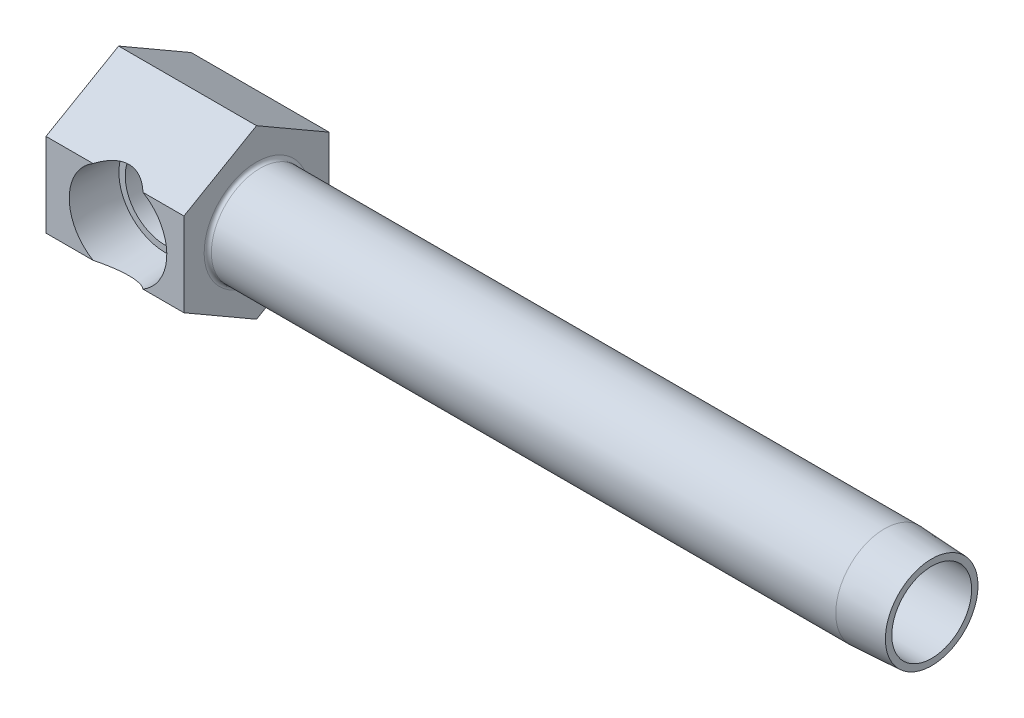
ISO-10303-21;
HEADER;
FILE_DESCRIPTION(('STEP AP214'),'2;1');
FILE_NAME('part.step','',(''),(''),'','','');
FILE_SCHEMA(('AUTOMOTIVE_DESIGN { 1 0 10303 214 1 1 1 1 }'));
ENDSEC;
DATA;
#1=APPLICATION_CONTEXT('core data for automotive mechanical design processes');
#2=APPLICATION_PROTOCOL_DEFINITION('international standard','automotive_design',2000,#1);
#3=PRODUCT_CONTEXT('',#1,'mechanical');
#4=PRODUCT('Part','Part','',(#3));
#5=PRODUCT_RELATED_PRODUCT_CATEGORY('part','',(#4));
#6=PRODUCT_DEFINITION_FORMATION('','',#4);
#7=PRODUCT_DEFINITION_CONTEXT('part definition',#1,'design');
#8=PRODUCT_DEFINITION('design','',#6,#7);
#9=PRODUCT_DEFINITION_SHAPE('','',#8);
#10=(LENGTH_UNIT() NAMED_UNIT(*) SI_UNIT(.MILLI.,.METRE.));
#11=(NAMED_UNIT(*) PLANE_ANGLE_UNIT() SI_UNIT($,.RADIAN.));
#12=(NAMED_UNIT(*) SI_UNIT($,.STERADIAN.) SOLID_ANGLE_UNIT());
#13=UNCERTAINTY_MEASURE_WITH_UNIT(LENGTH_MEASURE(1.E-05),#10,'distance_accuracy_value','');
#14=(GEOMETRIC_REPRESENTATION_CONTEXT(3) GLOBAL_UNCERTAINTY_ASSIGNED_CONTEXT((#13)) GLOBAL_UNIT_ASSIGNED_CONTEXT((#10,
#11,#12)) REPRESENTATION_CONTEXT('',''));
#15=CARTESIAN_POINT('',(0.,0.,0.));
#16=DIRECTION('',(0.,0.,1.));
#17=DIRECTION('',(1.,0.,0.));
#18=AXIS2_PLACEMENT_3D('',#15,#16,#17);
#19=CARTESIAN_POINT('',(63.5,0.,15.875));
#20=DIRECTION('',(-1.,0.,0.));
#21=DIRECTION('',(0.,0.,1.));
#22=AXIS2_PLACEMENT_3D('',#19,#20,#21);
#23=CYLINDRICAL_SURFACE('',#22,10.668);
#24=CARTESIAN_POINT('',(30.9499,0.,15.875));
#25=DIRECTION('',(1.,0.,0.));
#26=DIRECTION('',(0.,1.,0.));
#27=AXIS2_PLACEMENT_3D('',#24,#25,#26);
#28=CIRCLE('',#27,10.668);
#29=CARTESIAN_POINT('',(30.9499,10.668,15.875));
#30=VERTEX_POINT('',#29);
#31=EDGE_CURVE('E191',#30,#30,#28,.T.);
#32=ORIENTED_EDGE('',*,*,#31,.T.);
#33=EDGE_LOOP('',(#32));
#34=FACE_BOUND('',#33,.T.);
#35=CARTESIAN_POINT('',(167.4876,0.,15.875));
#36=DIRECTION('',(1.,0.,0.));
#37=DIRECTION('',(0.,0.,-1.));
#38=AXIS2_PLACEMENT_3D('',#35,#36,#37);
#39=CIRCLE('',#38,10.668);
#40=CARTESIAN_POINT('',(167.4876,0.,5.207));
#41=VERTEX_POINT('',#40);
#42=EDGE_CURVE('E256',#41,#41,#39,.T.);
#43=ORIENTED_EDGE('',*,*,#42,.F.);
#44=EDGE_LOOP('',(#43));
#45=FACE_BOUND('',#44,.T.);
#46=ADVANCED_FACE('F15',(#34,#45),#23,.T.);
#47=CARTESIAN_POINT('',(30.1625,18.3308710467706,15.875));
#48=DIRECTION('',(0.,-0.866025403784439,-0.5));
#49=DIRECTION('',(0.,0.5,-0.866025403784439));
#50=AXIS2_PLACEMENT_3D('',#47,#48,#49);
#51=PLANE('',#50);
#52=CARTESIAN_POINT('',(15.748,-1.05255916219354,49.4480859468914));
#53=DIRECTION('',(0.,-0.866025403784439,-0.5));
#54=DIRECTION('',(0.,-0.5,0.866025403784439));
#55=AXIS2_PLACEMENT_3D('',#52,#53,#54);
#56=ELLIPSE('',#55,23.191034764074,11.5476466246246);
#57=CARTESIAN_POINT('',(21.2070306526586,9.16543552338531,31.75));
#58=VERTEX_POINT('',#57);
#59=CARTESIAN_POINT('',(10.2889693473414,9.16543552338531,31.75));
#60=VERTEX_POINT('',#59);
#61=EDGE_CURVE('E135',#58,#60,#56,.F.);
#62=ORIENTED_EDGE('',*,*,#61,.F.);
#63=DIRECTION('',(-1.,0.,0.));
#64=VECTOR('',#63,1.);
#65=CARTESIAN_POINT('',(30.1625,9.16543552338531,31.75));
#66=LINE('',#65,#64);
#67=CARTESIAN_POINT('',(30.1625,9.16543552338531,31.75));
#68=VERTEX_POINT('',#67);
#69=EDGE_CURVE('E179',#68,#58,#66,.T.);
#70=ORIENTED_EDGE('',*,*,#69,.F.);
#71=DIRECTION('',(0.,-0.5,0.866025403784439));
#72=VECTOR('',#71,1.);
#73=CARTESIAN_POINT('',(30.1625,18.3308710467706,15.875));
#74=LINE('',#73,#72);
#75=CARTESIAN_POINT('',(30.1625,18.3308710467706,15.875));
#76=VERTEX_POINT('',#75);
#77=EDGE_CURVE('E163',#76,#68,#74,.T.);
#78=ORIENTED_EDGE('',*,*,#77,.F.);
#79=DIRECTION('',(-1.,0.,0.));
#80=VECTOR('',#79,1.);
#81=CARTESIAN_POINT('',(30.1625,18.3308710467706,15.875));
#82=LINE('',#81,#80);
#83=CARTESIAN_POINT('',(0.,18.3308710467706,15.875));
#84=VERTEX_POINT('',#83);
#85=EDGE_CURVE('E182',#76,#84,#82,.T.);
#86=ORIENTED_EDGE('',*,*,#85,.T.);
#87=DIRECTION('',(0.,-0.5,0.866025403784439));
#88=VECTOR('',#87,1.);
#89=CARTESIAN_POINT('',(0.,18.3308710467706,15.875));
#90=LINE('',#89,#88);
#91=CARTESIAN_POINT('',(0.,9.16543552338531,31.75));
#92=VERTEX_POINT('',#91);
#93=EDGE_CURVE('E144',#84,#92,#90,.T.);
#94=ORIENTED_EDGE('',*,*,#93,.T.);
#95=EDGE_CURVE('E178',#60,#92,#66,.T.);
#96=ORIENTED_EDGE('',*,*,#95,.F.);
#97=EDGE_LOOP('',(#62,#70,#78,#86,#94,#96));
#98=FACE_BOUND('',#97,.T.);
#99=ADVANCED_FACE('F210',(#98),#51,.F.);
#100=CARTESIAN_POINT('',(30.1625,9.16543552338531,31.75));
#101=DIRECTION('',(0.,0.,-1.));
#102=DIRECTION('',(-1.,0.,0.));
#103=AXIS2_PLACEMENT_3D('',#100,#101,#102);
#104=PLANE('',#103);
#105=CARTESIAN_POINT('',(15.748,0.,31.75));
#106=DIRECTION('',(0.,0.,-1.));
#107=DIRECTION('',(-1.,0.,0.));
#108=AXIS2_PLACEMENT_3D('',#105,#106,#107);
#109=CIRCLE('',#108,10.668);
#110=CARTESIAN_POINT('',(21.2070306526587,-9.1654355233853,31.75));
#111=VERTEX_POINT('',#110);
#112=EDGE_CURVE('E133',#58,#111,#109,.T.);
#113=ORIENTED_EDGE('',*,*,#112,.T.);
#114=DIRECTION('',(-1.,0.,0.));
#115=VECTOR('',#114,1.);
#116=CARTESIAN_POINT('',(30.1625,-9.1654355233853,31.75));
#117=LINE('',#116,#115);
#118=CARTESIAN_POINT('',(30.1625,-9.1654355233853,31.75));
#119=VERTEX_POINT('',#118);
#120=EDGE_CURVE('E175',#119,#111,#117,.T.);
#121=ORIENTED_EDGE('',*,*,#120,.F.);
#122=DIRECTION('',(0.,-1.,0.));
#123=VECTOR('',#122,1.);
#124=CARTESIAN_POINT('',(30.1625,9.16543552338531,31.75));
#125=LINE('',#124,#123);
#126=EDGE_CURVE('E165',#68,#119,#125,.T.);
#127=ORIENTED_EDGE('',*,*,#126,.F.);
#128=ORIENTED_EDGE('',*,*,#69,.T.);
#129=EDGE_LOOP('',(#113,#121,#127,#128));
#130=FACE_BOUND('',#129,.T.);
#131=ADVANCED_FACE('F206',(#130),#104,.F.);
#132=CARTESIAN_POINT('',(10.2889693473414,-9.1654355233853,31.75));
#133=VERTEX_POINT('',#132);
#134=EDGE_CURVE('E40',#133,#60,#109,.T.);
#135=ORIENTED_EDGE('',*,*,#134,.T.);
#136=ORIENTED_EDGE('',*,*,#95,.T.);
#137=DIRECTION('',(0.,-1.,0.));
#138=VECTOR('',#137,1.);
#139=CARTESIAN_POINT('',(0.,9.16543552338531,31.75));
#140=LINE('',#139,#138);
#141=CARTESIAN_POINT('',(0.,-9.1654355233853,31.75));
#142=VERTEX_POINT('',#141);
#143=EDGE_CURVE('E148',#92,#142,#140,.T.);
#144=ORIENTED_EDGE('',*,*,#143,.T.);
#145=EDGE_CURVE('E174',#133,#142,#117,.T.);
#146=ORIENTED_EDGE('',*,*,#145,.F.);
#147=EDGE_LOOP('',(#135,#136,#144,#146));
#148=FACE_BOUND('',#147,.T.);
#149=ADVANCED_FACE('F213',(#148),#104,.F.);
#150=CARTESIAN_POINT('',(30.1625,-9.1654355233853,31.75));
#151=DIRECTION('',(0.,0.866025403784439,-0.5));
#152=DIRECTION('',(0.,0.5,0.866025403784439));
#153=AXIS2_PLACEMENT_3D('',#150,#151,#152);
#154=PLANE('',#153);
#155=CARTESIAN_POINT('',(15.748,1.05255916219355,49.4480859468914));
#156=DIRECTION('',(0.,0.866025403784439,-0.5));
#157=DIRECTION('',(0.,0.5,0.866025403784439));
#158=AXIS2_PLACEMENT_3D('',#155,#156,#157);
#159=ELLIPSE('',#158,23.191034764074,11.5476466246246);
#160=EDGE_CURVE('E26',#133,#111,#159,.F.);
#161=ORIENTED_EDGE('',*,*,#160,.F.);
#162=ORIENTED_EDGE('',*,*,#145,.T.);
#163=DIRECTION('',(0.,-0.5,-0.866025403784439));
#164=VECTOR('',#163,1.);
#165=CARTESIAN_POINT('',(0.,-9.1654355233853,31.75));
#166=LINE('',#165,#164);
#167=CARTESIAN_POINT('',(0.,-18.3308710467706,15.875));
#168=VERTEX_POINT('',#167);
#169=EDGE_CURVE('E152',#142,#168,#166,.T.);
#170=ORIENTED_EDGE('',*,*,#169,.T.);
#171=DIRECTION('',(-1.,0.,0.));
#172=VECTOR('',#171,1.);
#173=CARTESIAN_POINT('',(30.1625,-18.3308710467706,15.875));
#174=LINE('',#173,#172);
#175=CARTESIAN_POINT('',(30.1625,-18.3308710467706,15.875));
#176=VERTEX_POINT('',#175);
#177=EDGE_CURVE('E169',#176,#168,#174,.T.);
#178=ORIENTED_EDGE('',*,*,#177,.F.);
#179=DIRECTION('',(0.,-0.5,-0.866025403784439));
#180=VECTOR('',#179,1.);
#181=CARTESIAN_POINT('',(30.1625,-9.1654355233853,31.75));
#182=LINE('',#181,#180);
#183=EDGE_CURVE('E167',#119,#176,#182,.T.);
#184=ORIENTED_EDGE('',*,*,#183,.F.);
#185=ORIENTED_EDGE('',*,*,#120,.T.);
#186=EDGE_LOOP('',(#161,#162,#170,#178,#184,#185));
#187=FACE_BOUND('',#186,.T.);
#188=ADVANCED_FACE('F202',(#187),#154,.F.);
#189=CARTESIAN_POINT('',(30.1625,-18.3308710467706,15.875));
#190=DIRECTION('',(0.,0.866025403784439,0.5));
#191=DIRECTION('',(0.,-0.5,0.866025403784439));
#192=AXIS2_PLACEMENT_3D('',#189,#190,#191);
#193=PLANE('',#192);
#194=DIRECTION('',(0.,0.5,-0.866025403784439));
#195=VECTOR('',#194,1.);
#196=CARTESIAN_POINT('',(0.,-18.3308710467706,15.875));
#197=LINE('',#196,#195);
#198=CARTESIAN_POINT('',(0.,-9.16543552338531,0.));
#199=VERTEX_POINT('',#198);
#200=EDGE_CURVE('E137',#168,#199,#197,.T.);
#201=ORIENTED_EDGE('',*,*,#200,.T.);
#202=DIRECTION('',(-1.,0.,0.));
#203=VECTOR('',#202,1.);
#204=CARTESIAN_POINT('',(30.1625,-9.16543552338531,0.));
#205=LINE('',#204,#203);
#206=CARTESIAN_POINT('',(30.1625,-9.16543552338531,0.));
#207=VERTEX_POINT('',#206);
#208=EDGE_CURVE('E188',#207,#199,#205,.T.);
#209=ORIENTED_EDGE('',*,*,#208,.F.);
#210=DIRECTION('',(0.,0.5,-0.866025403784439));
#211=VECTOR('',#210,1.);
#212=CARTESIAN_POINT('',(30.1625,-18.3308710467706,15.875));
#213=LINE('',#212,#211);
#214=EDGE_CURVE('E155',#176,#207,#213,.T.);
#215=ORIENTED_EDGE('',*,*,#214,.F.);
#216=ORIENTED_EDGE('',*,*,#177,.T.);
#217=EDGE_LOOP('',(#201,#209,#215,#216));
#218=FACE_BOUND('',#217,.T.);
#219=ADVANCED_FACE('F220',(#218),#193,.F.);
#220=CARTESIAN_POINT('',(30.1625,-9.16543552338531,0.));
#221=DIRECTION('',(0.,0.,1.));
#222=DIRECTION('',(0.,-1.,0.));
#223=AXIS2_PLACEMENT_3D('',#220,#221,#222);
#224=PLANE('',#223);
#225=DIRECTION('',(0.,1.,0.));
#226=VECTOR('',#225,1.);
#227=CARTESIAN_POINT('',(0.,-9.16543552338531,0.));
#228=LINE('',#227,#226);
#229=CARTESIAN_POINT('',(0.,9.16543552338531,0.));
#230=VERTEX_POINT('',#229);
#231=EDGE_CURVE('E138',#199,#230,#228,.T.);
#232=ORIENTED_EDGE('',*,*,#231,.T.);
#233=DIRECTION('',(-1.,0.,0.));
#234=VECTOR('',#233,1.);
#235=CARTESIAN_POINT('',(30.1625,9.16543552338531,0.));
#236=LINE('',#235,#234);
#237=CARTESIAN_POINT('',(30.1625,9.16543552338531,0.));
#238=VERTEX_POINT('',#237);
#239=EDGE_CURVE('E185',#238,#230,#236,.T.);
#240=ORIENTED_EDGE('',*,*,#239,.F.);
#241=DIRECTION('',(0.,1.,0.));
#242=VECTOR('',#241,1.);
#243=CARTESIAN_POINT('',(30.1625,-9.16543552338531,0.));
#244=LINE('',#243,#242);
#245=EDGE_CURVE('E159',#207,#238,#244,.T.);
#246=ORIENTED_EDGE('',*,*,#245,.F.);
#247=ORIENTED_EDGE('',*,*,#208,.T.);
#248=EDGE_LOOP('',(#232,#240,#246,#247));
#249=FACE_BOUND('',#248,.T.);
#250=ADVANCED_FACE('F227',(#249),#224,.F.);
#251=CARTESIAN_POINT('',(30.1625,9.16543552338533,0.));
#252=DIRECTION('',(0.,-0.86602540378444,0.5));
#253=DIRECTION('',(0.,-0.5,-0.86602540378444));
#254=AXIS2_PLACEMENT_3D('',#251,#252,#253);
#255=PLANE('',#254);
#256=DIRECTION('',(0.,0.5,0.86602540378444));
#257=VECTOR('',#256,1.);
#258=CARTESIAN_POINT('',(0.,9.16543552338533,0.));
#259=LINE('',#258,#257);
#260=EDGE_CURVE('E141',#230,#84,#259,.T.);
#261=ORIENTED_EDGE('',*,*,#260,.T.);
#262=ORIENTED_EDGE('',*,*,#85,.F.);
#263=DIRECTION('',(0.,0.5,0.86602540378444));
#264=VECTOR('',#263,1.);
#265=CARTESIAN_POINT('',(30.1625,9.16543552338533,0.));
#266=LINE('',#265,#264);
#267=EDGE_CURVE('E161',#238,#76,#266,.T.);
#268=ORIENTED_EDGE('',*,*,#267,.F.);
#269=ORIENTED_EDGE('',*,*,#239,.T.);
#270=EDGE_LOOP('',(#261,#262,#268,#269));
#271=FACE_BOUND('',#270,.T.);
#272=ADVANCED_FACE('F233',(#271),#255,.F.);
#273=CARTESIAN_POINT('',(30.1625,-9.16543552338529,0.));
#274=DIRECTION('',(1.,0.,0.));
#275=DIRECTION('',(0.,1.,0.));
#276=AXIS2_PLACEMENT_3D('',#273,#274,#275);
#277=PLANE('',#276);
#278=CARTESIAN_POINT('',(30.1625,0.,15.875));
#279=DIRECTION('',(1.,0.,0.));
#280=DIRECTION('',(0.,1.,0.));
#281=AXIS2_PLACEMENT_3D('',#278,#279,#280);
#282=CIRCLE('',#281,11.4554);
#283=CARTESIAN_POINT('',(30.1625,11.4554,15.875));
#284=VERTEX_POINT('',#283);
#285=EDGE_CURVE('E194',#284,#284,#282,.F.);
#286=ORIENTED_EDGE('',*,*,#285,.T.);
#287=EDGE_LOOP('',(#286));
#288=FACE_BOUND('',#287,.T.);
#289=ORIENTED_EDGE('',*,*,#214,.T.);
#290=ORIENTED_EDGE('',*,*,#245,.T.);
#291=ORIENTED_EDGE('',*,*,#267,.T.);
#292=ORIENTED_EDGE('',*,*,#77,.T.);
#293=ORIENTED_EDGE('',*,*,#126,.T.);
#294=ORIENTED_EDGE('',*,*,#183,.T.);
#295=EDGE_LOOP('',(#289,#290,#291,#292,#293,#294));
#296=FACE_BOUND('',#295,.T.);
#297=ADVANCED_FACE('F230',(#288,#296),#277,.T.);
#298=CARTESIAN_POINT('',(0.,-9.16543552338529,0.));
#299=DIRECTION('',(1.,0.,0.));
#300=DIRECTION('',(0.,1.,0.));
#301=AXIS2_PLACEMENT_3D('',#298,#299,#300);
#302=PLANE('',#301);
#303=ORIENTED_EDGE('',*,*,#200,.F.);
#304=ORIENTED_EDGE('',*,*,#169,.F.);
#305=ORIENTED_EDGE('',*,*,#143,.F.);
#306=ORIENTED_EDGE('',*,*,#93,.F.);
#307=ORIENTED_EDGE('',*,*,#260,.F.);
#308=ORIENTED_EDGE('',*,*,#231,.F.);
#309=EDGE_LOOP('',(#303,#304,#305,#306,#307,#308));
#310=FACE_BOUND('',#309,.T.);
#311=ADVANCED_FACE('F222',(#310),#302,.F.);
#312=CARTESIAN_POINT('',(30.9499,0.,15.875));
#313=DIRECTION('',(1.,0.,0.));
#314=DIRECTION('',(0.,1.,0.));
#315=AXIS2_PLACEMENT_3D('',#312,#313,#314);
#316=TOROIDAL_SURFACE('',#315,11.4554,0.7874);
#317=ORIENTED_EDGE('',*,*,#285,.F.);
#318=EDGE_LOOP('',(#317));
#319=FACE_BOUND('',#318,.T.);
#320=ORIENTED_EDGE('',*,*,#31,.F.);
#321=EDGE_LOOP('',(#320));
#322=FACE_BOUND('',#321,.T.);
#323=ADVANCED_FACE('F331',(#319,#322),#316,.F.);
#324=CARTESIAN_POINT('',(15.748,0.,31.75));
#325=DIRECTION('',(0.,0.,1.));
#326=DIRECTION('',(1.,0.,0.));
#327=AXIS2_PLACEMENT_3D('',#324,#325,#326);
#328=CONICAL_SURFACE('',#327,10.668,0.0523598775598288);
#329=CARTESIAN_POINT('',(23.3158678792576,-6.73011387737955,21.4374));
#330=CARTESIAN_POINT('',(23.4600282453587,-6.58213571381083,21.6163914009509));
#331=CARTESIAN_POINT('',(23.6023884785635,-6.42627781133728,21.7904706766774));
#332=CARTESIAN_POINT('',(23.8817354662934,-6.09837401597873,22.1280133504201));
#333=CARTESIAN_POINT('',(24.0187135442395,-5.92630339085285,22.2914598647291));
#334=CARTESIAN_POINT('',(24.2862441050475,-5.56440643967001,22.6077795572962));
#335=CARTESIAN_POINT('',(24.4167288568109,-5.37443622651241,22.7605461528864));
#336=CARTESIAN_POINT('',(24.6677167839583,-4.97815123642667,23.0522714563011));
#337=CARTESIAN_POINT('',(24.7882261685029,-4.77184678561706,23.1912387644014));
#338=CARTESIAN_POINT('',(24.9921660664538,-4.38969848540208,23.4250980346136));
#339=CARTESIAN_POINT('',(25.0779672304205,-4.21696245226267,23.5230096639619));
#340=CARTESIAN_POINT('',(25.2408840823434,-3.86199712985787,23.7082473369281));
#341=CARTESIAN_POINT('',(25.3180018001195,-3.67977007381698,23.7955758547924));
#342=CARTESIAN_POINT('',(25.4621670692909,-3.30686520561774,23.9583559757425));
#343=CARTESIAN_POINT('',(25.529240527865,-3.11621083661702,24.0338381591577));
#344=CARTESIAN_POINT('',(25.6523303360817,-2.72696762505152,24.1720474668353));
#345=CARTESIAN_POINT('',(25.7083523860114,-2.52838293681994,24.2347811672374));
#346=CARTESIAN_POINT('',(25.808749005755,-2.12236093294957,24.3470188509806));
#347=CARTESIAN_POINT('',(25.8530023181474,-1.91485526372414,24.3963851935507));
#348=CARTESIAN_POINT('',(25.9281094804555,-1.49442789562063,24.4800766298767));
#349=CARTESIAN_POINT('',(25.9589631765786,-1.2815061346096,24.5144015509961));
#350=CARTESIAN_POINT('',(26.0065047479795,-0.852126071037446,24.5672608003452));
#351=CARTESIAN_POINT('',(26.023192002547,-0.635667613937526,24.5857944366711));
#352=CARTESIAN_POINT('',(26.0419565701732,-0.201352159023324,24.6066338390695));
#353=CARTESIAN_POINT('',(26.0440358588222,0.0165046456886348,24.6089417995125));
#354=CARTESIAN_POINT('',(26.0342583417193,0.421689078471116,24.5980844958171));
#355=CARTESIAN_POINT('',(26.0242658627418,0.609123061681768,24.5869892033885));
#356=CARTESIAN_POINT('',(25.9935596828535,0.982016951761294,24.552869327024));
#357=CARTESIAN_POINT('',(25.9728460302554,1.16747686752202,24.5298447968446));
#358=CARTESIAN_POINT('',(25.9211099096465,1.53498981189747,24.4722733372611));
#359=CARTESIAN_POINT('',(25.8900948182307,1.71704518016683,24.437734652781));
#360=CARTESIAN_POINT('',(25.8183100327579,2.07675633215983,24.3576745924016));
#361=CARTESIAN_POINT('',(25.7775399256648,2.25441192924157,24.3121527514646));
#362=CARTESIAN_POINT('',(25.6868155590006,2.6047674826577,24.2106610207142));
#363=CARTESIAN_POINT('',(25.6368406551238,2.77745527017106,24.1546676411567));
#364=CARTESIAN_POINT('',(25.5285266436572,3.11671661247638,24.0330221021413));
#365=CARTESIAN_POINT('',(25.4701845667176,3.28328797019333,23.9673665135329));
#366=CARTESIAN_POINT('',(25.2834921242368,3.77365322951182,23.7566792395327));
#367=CARTESIAN_POINT('',(25.1436492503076,4.08744436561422,23.5981203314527));
#368=CARTESIAN_POINT('',(24.8735653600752,4.61896069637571,23.289353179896));
#369=CARTESIAN_POINT('',(24.7480029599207,4.84261456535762,23.1450088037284));
#370=CARTESIAN_POINT('',(24.4850001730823,5.27158893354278,22.8402219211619));
#371=CARTESIAN_POINT('',(24.34754826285,5.47689124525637,22.6797637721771));
#372=CARTESIAN_POINT('',(24.0644488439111,5.86754844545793,22.3458754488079));
#373=CARTESIAN_POINT('',(23.918859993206,6.05302358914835,22.1725357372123));
#374=CARTESIAN_POINT('',(23.6957580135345,6.31733501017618,21.90341371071));
#375=CARTESIAN_POINT('',(23.6206767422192,6.40304815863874,21.8122772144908));
#376=CARTESIAN_POINT('',(23.4691939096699,6.56995442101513,21.6270388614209));
#377=CARTESIAN_POINT('',(23.3927925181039,6.65114811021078,21.5329373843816));
#378=CARTESIAN_POINT('',(23.3158678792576,6.73011387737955,21.4374));
#379=B_SPLINE_CURVE_WITH_KNOTS('',3,(#329,#330,#331,#332,#333,#334,#335,#336,#337,#338,#339,
#340,#341,#342,#343,#344,#345,#346,#347,#348,#349,#350,#351,#352,#353,#354,#355,#356,#357,#358,
#359,#360,#361,#362,#363,#364,#365,#366,#367,#368,#369,#370,#371,#372,#373,#374,#375,#376,#377,
#378),.UNSPECIFIED.,.F.,.F.,(4,2,2,2,2,2,2,2,2,2,2,2,2,2,2,2,2,2,2,2,2,2,2,2,4),(0.,
0.820023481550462,1.64131879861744,2.46989520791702,3.29795193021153,3.94627694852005,
4.59445010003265,5.24092150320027,5.8870585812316,6.53961554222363,7.19217999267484,
7.84477303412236,8.49727781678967,9.06067705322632,9.6240737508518,10.187067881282,
10.7500858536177,11.3143822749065,11.8788794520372,13.0099648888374,13.8917191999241,
14.7743379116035,15.65125682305,16.0888974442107,16.5264822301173),.UNSPECIFIED.);
#380=CARTESIAN_POINT('',(23.3160289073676,-6.72994857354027,21.4376));
#381=VERTEX_POINT('',#380);
#382=CARTESIAN_POINT('',(23.3160289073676,6.72994857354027,21.4376));
#383=VERTEX_POINT('',#382);
#384=EDGE_CURVE('E119',#381,#383,#379,.T.);
#385=ORIENTED_EDGE('',*,*,#384,.F.);
#386=CARTESIAN_POINT('',(15.748,0.,21.4376));
#387=DIRECTION('',(0.,0.,-1.));
#388=DIRECTION('',(-1.,0.,0.));
#389=AXIS2_PLACEMENT_3D('',#386,#387,#388);
#390=CIRCLE('',#389,10.1275500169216);
#391=EDGE_CURVE('E121',#381,#383,#390,.T.);
#392=ORIENTED_EDGE('',*,*,#391,.T.);
#393=EDGE_LOOP('',(#385,#392));
#394=FACE_BOUND('',#393,.T.);
#395=ORIENTED_EDGE('',*,*,#61,.T.);
#396=ORIENTED_EDGE('',*,*,#134,.F.);
#397=ORIENTED_EDGE('',*,*,#160,.T.);
#398=ORIENTED_EDGE('',*,*,#112,.F.);
#399=EDGE_LOOP('',(#395,#396,#397,#398));
#400=FACE_BOUND('',#399,.T.);
#401=ADVANCED_FACE('F196',(#394,#400),#328,.F.);
#402=CARTESIAN_POINT('',(25.8755500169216,0.,21.4376));
#403=DIRECTION('',(0.,0.,1.));
#404=DIRECTION('',(1.,0.,0.));
#405=AXIS2_PLACEMENT_3D('',#402,#403,#404);
#406=PLANE('',#405);
#407=DIRECTION('',(1.,0.,0.));
#408=VECTOR('',#407,1.);
#409=CARTESIAN_POINT('',(86.8155901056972,-6.72994857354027,21.4376));
#410=LINE('',#409,#408);
#411=CARTESIAN_POINT('',(21.3205618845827,-6.72994857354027,21.4376));
#412=VERTEX_POINT('',#411);
#413=EDGE_CURVE('E123',#412,#381,#410,.T.);
#414=ORIENTED_EDGE('',*,*,#413,.F.);
#415=CARTESIAN_POINT('',(15.748,0.,21.4376));
#416=DIRECTION('',(0.,0.,-1.));
#417=DIRECTION('',(-1.,0.,0.));
#418=AXIS2_PLACEMENT_3D('',#415,#416,#417);
#419=CIRCLE('',#418,8.7376);
#420=CARTESIAN_POINT('',(21.3205618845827,6.72994857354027,21.4376));
#421=VERTEX_POINT('',#420);
#422=EDGE_CURVE('E114',#412,#421,#419,.T.);
#423=ORIENTED_EDGE('',*,*,#422,.T.);
#424=DIRECTION('',(1.,0.,0.));
#425=VECTOR('',#424,1.);
#426=CARTESIAN_POINT('',(86.8155901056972,6.72994857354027,21.4376));
#427=LINE('',#426,#425);
#428=EDGE_CURVE('E115',#383,#421,#427,.F.);
#429=ORIENTED_EDGE('',*,*,#428,.F.);
#430=ORIENTED_EDGE('',*,*,#391,.F.);
#431=EDGE_LOOP('',(#414,#423,#429,#430));
#432=FACE_BOUND('',#431,.T.);
#433=ADVANCED_FACE('F316',(#432),#406,.T.);
#434=CARTESIAN_POINT('',(15.748,0.,43.0975954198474));
#435=DIRECTION('',(0.,0.,-1.));
#436=DIRECTION('',(-1.,0.,0.));
#437=AXIS2_PLACEMENT_3D('',#434,#435,#436);
#438=CYLINDRICAL_SURFACE('',#437,8.7376);
#439=CARTESIAN_POINT('',(24.4856,0.,7.14375000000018));
#440=CARTESIAN_POINT('',(24.4855979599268,-0.194584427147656,7.14375204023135));
#441=CARTESIAN_POINT('',(24.4790855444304,-0.389211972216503,7.15026918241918));
#442=CARTESIAN_POINT('',(24.4531687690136,-0.776828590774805,7.17620489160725));
#443=CARTESIAN_POINT('',(24.4337566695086,-0.969816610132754,7.19563120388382));
#444=CARTESIAN_POINT('',(24.3824080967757,-1.35279132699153,7.24701779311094));
#445=CARTESIAN_POINT('',(24.3504484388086,-1.54277178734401,7.27900127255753));
#446=CARTESIAN_POINT('',(24.2746397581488,-1.91800162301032,7.3548673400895));
#447=CARTESIAN_POINT('',(24.230784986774,-2.10324866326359,7.39875568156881));
#448=CARTESIAN_POINT('',(24.1323992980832,-2.46629304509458,7.49721818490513));
#449=CARTESIAN_POINT('',(24.0779544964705,-2.64413729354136,7.55170615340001));
#450=CARTESIAN_POINT('',(23.9590478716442,-2.99304779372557,7.6707093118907));
#451=CARTESIAN_POINT('',(23.8945822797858,-3.16411146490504,7.73522827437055));
#452=CARTESIAN_POINT('',(23.7566100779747,-3.49864884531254,7.87331790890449));
#453=CARTESIAN_POINT('',(23.6831076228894,-3.66212599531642,7.94688442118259));
#454=CARTESIAN_POINT('',(23.5279457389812,-3.98115293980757,8.10218588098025));
#455=CARTESIAN_POINT('',(23.4462844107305,-4.13670087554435,8.18392273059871));
#456=CARTESIAN_POINT('',(23.2407563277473,-4.50158308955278,8.38964777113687));
#457=CARTESIAN_POINT('',(23.1132942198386,-4.7068770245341,8.51723745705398));
#458=CARTESIAN_POINT('',(22.84617651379,-5.10080513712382,8.7846388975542));
#459=CARTESIAN_POINT('',(22.7065197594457,-5.28943773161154,8.92445181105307));
#460=CARTESIAN_POINT('',(22.4166157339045,-5.65057111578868,9.21470277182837));
#461=CARTESIAN_POINT('',(22.2663444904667,-5.82303320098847,9.36516487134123));
#462=CARTESIAN_POINT('',(21.9571971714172,-6.15161912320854,9.67473646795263));
#463=CARTESIAN_POINT('',(21.7983210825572,-6.30774293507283,9.83384597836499));
#464=CARTESIAN_POINT('',(21.410466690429,-6.66146937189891,10.2223222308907));
#465=CARTESIAN_POINT('',(21.1781519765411,-6.85174414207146,10.4550504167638));
#466=CARTESIAN_POINT('',(20.7027527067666,-7.20301910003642,10.9314300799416));
#467=CARTESIAN_POINT('',(20.4596630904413,-7.36400534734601,11.1750866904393));
#468=CARTESIAN_POINT('',(19.9655914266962,-7.65767994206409,11.6705392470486));
#469=CARTESIAN_POINT('',(19.7146188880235,-7.79040098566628,11.922325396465));
#470=CARTESIAN_POINT('',(19.2066974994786,-8.0288054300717,12.432296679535));
#471=CARTESIAN_POINT('',(18.9497514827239,-8.13450137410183,12.6904787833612));
#472=CARTESIAN_POINT('',(18.535849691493,-8.28254836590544,13.1070621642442));
#473=CARTESIAN_POINT('',(18.3802144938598,-8.3332845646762,13.2638590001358));
#474=CARTESIAN_POINT('',(18.0678223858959,-8.42559206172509,13.5791092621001));
#475=CARTESIAN_POINT('',(17.9110652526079,-8.46716148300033,13.7375630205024));
#476=CARTESIAN_POINT('',(17.6309955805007,-8.53322740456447,14.0215802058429));
#477=CARTESIAN_POINT('',(17.5077848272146,-8.5594718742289,14.1468425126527));
#478=CARTESIAN_POINT('',(17.2618022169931,-8.60637337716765,14.3980579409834));
#479=CARTESIAN_POINT('',(17.1390302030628,-8.62704779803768,14.5240076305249));
#480=CARTESIAN_POINT('',(16.9357825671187,-8.65687758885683,14.7346643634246));
#481=CARTESIAN_POINT('',(16.8550481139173,-8.66756378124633,14.8189101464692));
#482=CARTESIAN_POINT('',(16.6937016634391,-8.68665280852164,14.9894220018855));
#483=CARTESIAN_POINT('',(16.6130990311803,-8.6950316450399,15.0756998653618));
#484=CARTESIAN_POINT('',(16.4936864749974,-8.70581636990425,15.2075729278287));
#485=CARTESIAN_POINT('',(16.453897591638,-8.70912835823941,15.2522143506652));
#486=CARTESIAN_POINT('',(16.3753514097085,-8.71513811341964,15.3428639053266));
#487=CARTESIAN_POINT('',(16.336600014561,-8.71783283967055,15.3888775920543));
#488=CARTESIAN_POINT('',(16.2623845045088,-8.72252382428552,15.4819945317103));
#489=CARTESIAN_POINT('',(16.2268715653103,-8.72453249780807,15.5290599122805));
#490=CARTESIAN_POINT('',(16.1615894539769,-8.72786360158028,15.6269900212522));
#491=CARTESIAN_POINT('',(16.1317624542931,-8.72919320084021,15.6778082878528));
#492=CARTESIAN_POINT('',(16.106026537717,-8.73026315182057,15.7432733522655));
#493=CARTESIAN_POINT('',(16.1020065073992,-8.73042652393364,15.7545502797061));
#494=CARTESIAN_POINT('',(16.0948910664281,-8.73071197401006,15.7773932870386));
#495=CARTESIAN_POINT('',(16.0917959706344,-8.73083403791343,15.788959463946));
#496=CARTESIAN_POINT('',(16.0842173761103,-8.7311305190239,15.8238300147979));
#497=CARTESIAN_POINT('',(16.0813461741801,-8.7312389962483,15.8475287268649));
#498=CARTESIAN_POINT('',(16.080808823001,-8.73125946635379,15.8951415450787));
#499=CARTESIAN_POINT('',(16.083177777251,-8.73117013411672,15.9190560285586));
#500=CARTESIAN_POINT('',(16.0925113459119,-8.73080677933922,15.9661053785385));
#501=CARTESIAN_POINT('',(16.099514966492,-8.73053118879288,15.9892318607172));
#502=CARTESIAN_POINT('',(16.1262284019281,-8.72942751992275,16.0598051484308));
#503=CARTESIAN_POINT('',(16.151337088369,-8.7283274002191,16.1050597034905));
#504=CARTESIAN_POINT('',(16.2067600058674,-8.72559491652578,16.1922079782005));
#505=CARTESIAN_POINT('',(16.2371111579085,-8.72395869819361,16.2340745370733));
#506=CARTESIAN_POINT('',(16.3394034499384,-8.71784635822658,16.3674166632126));
#507=CARTESIAN_POINT('',(16.4158450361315,-8.71237926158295,16.4553852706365));
#508=CARTESIAN_POINT('',(16.5713693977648,-8.69907947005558,16.6287851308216));
#509=CARTESIAN_POINT('',(16.6504566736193,-8.69124254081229,16.7142115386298));
#510=CARTESIAN_POINT('',(16.8096315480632,-8.67323190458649,16.8834717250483));
#511=CARTESIAN_POINT('',(16.8897156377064,-8.66306494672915,16.9673093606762));
#512=CARTESIAN_POINT('',(17.0502749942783,-8.64038918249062,17.1341543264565));
#513=CARTESIAN_POINT('',(17.1307499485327,-8.62788201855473,17.2171621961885));
#514=CARTESIAN_POINT('',(17.3707828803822,-8.58710464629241,17.463693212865));
#515=CARTESIAN_POINT('',(17.5305844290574,-8.5553951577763,17.626432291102));
#516=CARTESIAN_POINT('',(17.8496978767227,-8.48264950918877,17.9503078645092));
#517=CARTESIAN_POINT('',(18.0090097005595,-8.44161198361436,18.1114441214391));
#518=CARTESIAN_POINT('',(18.4856528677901,-8.30423407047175,18.592695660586));
#519=CARTESIAN_POINT('',(18.8014587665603,-8.1936672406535,18.9104166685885));
#520=CARTESIAN_POINT('',(19.4255974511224,-7.93318916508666,19.5375986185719));
#521=CARTESIAN_POINT('',(19.7339228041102,-7.78324040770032,19.8470513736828));
#522=CARTESIAN_POINT('',(20.3391141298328,-7.44229907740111,20.4540803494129));
#523=CARTESIAN_POINT('',(20.6359893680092,-7.25134054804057,20.7516661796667));
#524=CARTESIAN_POINT('',(21.1000219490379,-6.910044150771,21.2166598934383));
#525=CARTESIAN_POINT('',(21.2721889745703,-6.7733595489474,21.3891483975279));
#526=CARTESIAN_POINT('',(21.6095045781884,-6.48366113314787,21.7270430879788));
#527=CARTESIAN_POINT('',(21.7746536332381,-6.33064843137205,21.8924497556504));
#528=CARTESIAN_POINT('',(22.2570327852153,-5.84682072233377,22.3755293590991));
#529=CARTESIAN_POINT('',(22.5620480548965,-5.49060305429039,22.6809166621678));
#530=CARTESIAN_POINT('',(23.069916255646,-4.78392446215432,23.1893448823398));
#531=CARTESIAN_POINT('',(23.2811256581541,-4.44561570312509,23.4007639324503));
#532=CARTESIAN_POINT('',(23.5668242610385,-3.90553017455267,23.6867285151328));
#533=CARTESIAN_POINT('',(23.6568667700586,-3.72007663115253,23.7768515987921));
#534=CARTESIAN_POINT('',(23.8252338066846,-3.33876204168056,23.9453649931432));
#535=CARTESIAN_POINT('',(23.9035605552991,-3.14290297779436,24.0237575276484));
#536=CARTESIAN_POINT('',(24.0342740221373,-2.77741093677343,24.1545782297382));
#537=CARTESIAN_POINT('',(24.0887969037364,-2.60930304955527,24.2091448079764));
#538=CARTESIAN_POINT('',(24.1881404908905,-2.26745357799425,24.3085667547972));
#539=CARTESIAN_POINT('',(24.232963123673,-2.0937131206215,24.3534240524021));
#540=CARTESIAN_POINT('',(24.3121701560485,-1.74160557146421,24.4326916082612));
#541=CARTESIAN_POINT('',(24.3465592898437,-1.5632406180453,24.4671066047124));
#542=CARTESIAN_POINT('',(24.4043171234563,-1.20295803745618,24.5249075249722));
#543=CARTESIAN_POINT('',(24.427685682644,-1.02104036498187,24.548293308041));
#544=CARTESIAN_POINT('',(24.463023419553,-0.654283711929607,24.5836569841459));
#545=CARTESIAN_POINT('',(24.4749486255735,-0.46943621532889,24.5955908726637));
#546=CARTESIAN_POINT('',(24.4870048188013,-0.0989697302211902,24.6076558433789));
#547=CARTESIAN_POINT('',(24.4871357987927,0.086649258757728,24.6077869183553));
#548=CARTESIAN_POINT('',(24.4756009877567,0.457153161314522,24.59624371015));
#549=CARTESIAN_POINT('',(24.4639348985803,0.642038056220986,24.5845691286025));
#550=CARTESIAN_POINT('',(24.4290390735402,1.00960102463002,24.5496476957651));
#551=CARTESIAN_POINT('',(24.4058095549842,1.19227913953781,24.5264010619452));
#552=CARTESIAN_POINT('',(24.3499037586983,1.5435978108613,24.4704535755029));
#553=CARTESIAN_POINT('',(24.3178522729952,1.71243875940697,24.4383780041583));
#554=CARTESIAN_POINT('',(24.2443827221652,2.0460500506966,24.3648524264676));
#555=CARTESIAN_POINT('',(24.2029611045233,2.21081882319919,24.3233988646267));
#556=CARTESIAN_POINT('',(24.1113637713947,2.53539687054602,24.231729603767));
#557=CARTESIAN_POINT('',(24.0611880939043,2.69520616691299,24.1815139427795));
#558=CARTESIAN_POINT('',(23.9527394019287,3.0092382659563,24.0729769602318));
#559=CARTESIAN_POINT('',(23.8944647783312,3.16345995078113,24.0146540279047));
#560=CARTESIAN_POINT('',(23.7478576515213,3.52103226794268,23.8679223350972));
#561=CARTESIAN_POINT('',(23.6563189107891,3.72176242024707,23.776303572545));
#562=CARTESIAN_POINT('',(23.4611265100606,4.11105686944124,23.5809334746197));
#563=CARTESIAN_POINT('',(23.3574693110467,4.29961758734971,23.4771785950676));
#564=CARTESIAN_POINT('',(23.1395028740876,4.66439092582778,23.2589969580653));
#565=CARTESIAN_POINT('',(23.0251788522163,4.84058579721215,23.1445553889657));
#566=CARTESIAN_POINT('',(22.7874660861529,5.18020722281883,22.9065848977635));
#567=CARTESIAN_POINT('',(22.6640769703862,5.34363325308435,22.7830556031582));
#568=CARTESIAN_POINT('',(22.3624933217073,5.71583582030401,22.4811084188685));
#569=CARTESIAN_POINT('',(22.1808835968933,5.9190794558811,22.2992637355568));
#570=CARTESIAN_POINT('',(21.8058537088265,6.30238103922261,21.9236994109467));
#571=CARTESIAN_POINT('',(21.6124292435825,6.48243046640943,21.7299754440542));
#572=CARTESIAN_POINT('',(21.2157200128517,6.8203891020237,21.3325794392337));
#573=CARTESIAN_POINT('',(21.0124171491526,6.97825543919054,21.1288891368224));
#574=CARTESIAN_POINT('',(20.5982380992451,7.27223101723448,20.7138083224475));
#575=CARTESIAN_POINT('',(20.3873623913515,7.40834162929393,20.5024182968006));
#576=CARTESIAN_POINT('',(19.884649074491,7.70363293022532,19.9982794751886));
#577=CARTESIAN_POINT('',(19.59030513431,7.85421669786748,19.7029484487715));
#578=CARTESIAN_POINT('',(19.1430322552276,8.05270383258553,19.2536843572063));
#579=CARTESIAN_POINT('',(18.9929116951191,8.11432340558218,19.1028145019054));
#580=CARTESIAN_POINT('',(18.6911065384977,8.2285969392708,18.7992470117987));
#581=CARTESIAN_POINT('',(18.5394220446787,8.28125148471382,18.6465494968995));
#582=CARTESIAN_POINT('',(18.2352261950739,8.37763466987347,18.3399014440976));
#583=CARTESIAN_POINT('',(18.0827174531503,8.42138304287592,18.1859544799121));
#584=CARTESIAN_POINT('',(17.7769311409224,8.5002358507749,17.8765529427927));
#585=CARTESIAN_POINT('',(17.6236534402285,8.53533876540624,17.721098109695));
#586=CARTESIAN_POINT('',(17.3172180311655,8.59695458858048,17.4087584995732));
#587=CARTESIAN_POINT('',(17.164060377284,8.62347694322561,17.2518754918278));
#588=CARTESIAN_POINT('',(16.8589569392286,8.66804695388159,16.935768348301));
#589=CARTESIAN_POINT('',(16.7070105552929,8.68609909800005,16.7765454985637));
#590=CARTESIAN_POINT('',(16.46350407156,8.70877341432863,16.5098735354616));
#591=CARTESIAN_POINT('',(16.3699008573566,8.71589085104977,16.4044258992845));
#592=CARTESIAN_POINT('',(16.2323264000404,8.72430499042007,16.2291085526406));
#593=CARTESIAN_POINT('',(16.1841543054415,8.72679002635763,16.163138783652));
#594=CARTESIAN_POINT('',(16.133496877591,8.729101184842,16.0698810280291));
#595=CARTESIAN_POINT('',(16.1225051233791,8.72957575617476,16.0475182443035));
#596=CARTESIAN_POINT('',(16.1036531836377,8.73036364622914,16.0015173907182));
#597=CARTESIAN_POINT('',(16.0957832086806,8.73067746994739,15.9778835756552));
#598=CARTESIAN_POINT('',(16.0858252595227,8.73106804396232,15.9345234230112));
#599=CARTESIAN_POINT('',(16.0828762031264,8.73118048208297,15.9150042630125));
#600=CARTESIAN_POINT('',(16.0804848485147,8.73127193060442,15.8757632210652));
#601=CARTESIAN_POINT('',(16.0810378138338,8.73125112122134,15.8560416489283));
#602=CARTESIAN_POINT('',(16.085496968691,8.73107971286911,15.8170943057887));
#603=CARTESIAN_POINT('',(16.0893884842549,8.7309296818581,15.7978667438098));
#604=CARTESIAN_POINT('',(16.0998433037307,8.73051484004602,15.7601398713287));
#605=CARTESIAN_POINT('',(16.1064126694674,8.73024976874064,15.7416423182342));
#606=CARTESIAN_POINT('',(16.1364699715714,8.72898749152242,15.6687660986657));
#607=CARTESIAN_POINT('',(16.167275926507,8.72759479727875,15.6175941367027));
#608=CARTESIAN_POINT('',(16.2343481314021,8.72412321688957,15.51885530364));
#609=CARTESIAN_POINT('',(16.2706691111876,8.72203717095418,15.4713327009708));
#610=CARTESIAN_POINT('',(16.3943809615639,8.71408023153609,15.3171540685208));
#611=CARTESIAN_POINT('',(16.4865189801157,8.70682435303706,15.2143256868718));
#612=CARTESIAN_POINT('',(16.6731786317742,8.68900060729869,15.0111482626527));
#613=CARTESIAN_POINT('',(16.7677038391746,8.67842746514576,14.9108034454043));
#614=CARTESIAN_POINT('',(16.9573900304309,8.65402061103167,14.7119565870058));
#615=CARTESIAN_POINT('',(17.0525458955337,8.64020255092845,14.6134480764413));
#616=CARTESIAN_POINT('',(17.2430914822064,8.60927992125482,14.4173129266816));
#617=CARTESIAN_POINT('',(17.3384810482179,8.59217714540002,14.3196858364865));
#618=CARTESIAN_POINT('',(17.7459864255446,8.51203730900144,13.9038911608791));
#619=CARTESIAN_POINT('',(18.0580987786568,8.43292269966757,13.5886112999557));
#620=CARTESIAN_POINT('',(18.6776048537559,8.23825366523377,12.9641986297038));
#621=CARTESIAN_POINT('',(18.9849941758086,8.1226671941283,12.655071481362));
#622=CARTESIAN_POINT('',(19.5923220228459,7.85348929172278,12.0450114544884));
#623=CARTESIAN_POINT('',(19.8922482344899,7.6998391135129,11.744092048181));
#624=CARTESIAN_POINT('',(20.4804833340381,7.35294307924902,11.1542044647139));
#625=CARTESIAN_POINT('',(20.7688011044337,7.15972821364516,10.865227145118));
#626=CARTESIAN_POINT('',(21.2206780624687,6.81483228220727,10.4124550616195));
#627=CARTESIAN_POINT('',(21.3891940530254,6.67617271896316,10.2436383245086));
#628=CARTESIAN_POINT('',(21.7190895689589,6.38282740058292,9.91319894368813));
#629=CARTESIAN_POINT('',(21.8804695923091,6.22814276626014,9.75157579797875));
#630=CARTESIAN_POINT('',(22.3513310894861,5.73984762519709,9.28005235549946));
#631=CARTESIAN_POINT('',(22.6484248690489,5.38133142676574,8.9826055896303));
#632=CARTESIAN_POINT('',(23.141492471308,4.67228730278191,8.48900613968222));
#633=CARTESIAN_POINT('',(23.3459092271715,4.33363653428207,8.2843900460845));
#634=CARTESIAN_POINT('',(23.62145792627,3.79409663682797,8.00858862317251));
#635=CARTESIAN_POINT('',(23.7081391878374,3.60895802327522,7.92183082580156));
#636=CARTESIAN_POINT('',(23.8698120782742,3.2286920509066,7.76001907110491));
#637=CARTESIAN_POINT('',(23.9448062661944,3.03356689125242,7.68496255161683));
#638=CARTESIAN_POINT('',(24.0697191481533,2.66926471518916,7.55994813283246));
#639=CARTESIAN_POINT('',(24.1217294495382,2.50151910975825,7.50789648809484));
#640=CARTESIAN_POINT('',(24.2160793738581,2.16067893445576,7.41347268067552));
#641=CARTESIAN_POINT('',(24.2584209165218,1.98758543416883,7.37109859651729));
#642=CARTESIAN_POINT('',(24.3326749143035,1.63737162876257,7.29678816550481));
#643=CARTESIAN_POINT('',(24.3646094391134,1.46026070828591,7.26482973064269));
#644=CARTESIAN_POINT('',(24.4175977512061,1.10287331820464,7.21180203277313));
#645=CARTESIAN_POINT('',(24.4386569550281,0.922598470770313,7.1907273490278));
#646=CARTESIAN_POINT('',(24.4645620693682,0.61842168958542,7.16480325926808));
#647=CARTESIAN_POINT('',(24.472443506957,0.495022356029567,7.15691607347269));
#648=CARTESIAN_POINT('',(24.48296362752,0.247754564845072,7.14638828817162));
#649=CARTESIAN_POINT('',(24.4856012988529,0.123886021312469,7.14374870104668));
#650=CARTESIAN_POINT('',(24.4856,0.,7.14375000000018));
#651=B_SPLINE_CURVE_WITH_KNOTS('',3,(#439,#440,#441,#442,#443,#444,#445,#446,#447,#448,#449,
#450,#451,#452,#453,#454,#455,#456,#457,#458,#459,#460,#461,#462,#463,#464,#465,#466,#467,#468,
#469,#470,#471,#472,#473,#474,#475,#476,#477,#478,#479,#480,#481,#482,#483,#484,#485,#486,#487,
#488,#489,#490,#491,#492,#493,#494,#495,#496,#497,#498,#499,#500,#501,#502,#503,#504,#505,#506,
#507,#508,#509,#510,#511,#512,#513,#514,#515,#516,#517,#518,#519,#520,#521,#522,#523,#524,#525,
#526,#527,#528,#529,#530,#531,#532,#533,#534,#535,#536,#537,#538,#539,#540,#541,#542,#543,#544,
#545,#546,#547,#548,#549,#550,#551,#552,#553,#554,#555,#556,#557,#558,#559,#560,#561,#562,#563,
#564,#565,#566,#567,#568,#569,#570,#571,#572,#573,#574,#575,#576,#577,#578,#579,#580,#581,#582,
#583,#584,#585,#586,#587,#588,#589,#590,#591,#592,#593,#594,#595,#596,#597,#598,#599,#600,#601,
#602,#603,#604,#605,#606,#607,#608,#609,#610,#611,#612,#613,#614,#615,#616,#617,#618,#619,#620,
#621,#622,#623,#624,#625,#626,#627,#628,#629,#630,#631,#632,#633,#634,#635,#636,#637,#638,#639,
#640,#641,#642,#643,#644,#645,#646,#647,#648,#649,#650),.UNSPECIFIED.,.T.,.F.,(4,2,2,2,2,2,2,2,
2,2,2,2,2,2,2,2,2,2,2,2,2,2,2,2,2,2,2,2,2,2,2,2,2,2,2,2,2,2,2,2,2,2,2,2,2,2,2,2,2,2,2,2,2,2,2,2,
2,2,2,2,2,2,2,2,2,2,2,2,2,2,2,2,2,2,2,2,2,2,2,2,2,2,2,2,2,2,2,2,2,2,2,2,2,2,2,2,2,2,2,2,2,2,2,2,
2,4),(0.,0.583612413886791,1.16757530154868,1.75262232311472,2.3379525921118,2.91870833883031,
3.49968302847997,4.08039159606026,4.66123567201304,5.47979311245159,6.29842824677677,
7.11897529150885,7.93952359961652,9.07759978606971,10.2162162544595,11.3535083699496,
12.4902716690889,13.1701291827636,13.85012577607,14.3830023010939,14.9141955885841,
15.2656970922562,15.62072714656,15.8004033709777,15.9809464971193,16.1580238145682,
16.3331909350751,16.3690696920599,16.4049606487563,16.4760278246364,16.5475725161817,
16.61972713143,16.7737867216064,16.9289791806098,17.2784485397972,17.6285460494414,
17.9776420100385,18.3264938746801,19.0170858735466,19.7077790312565,21.0901665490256,
22.4738756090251,23.8564404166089,24.6940964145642,25.5316953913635,27.2028655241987,
28.5515700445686,29.225841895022,29.8999857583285,30.4543223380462,31.0085486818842,
31.5625231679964,32.1165047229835,32.67260655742,33.2287087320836,33.7848249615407,
34.3409307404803,34.8648402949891,35.3889488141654,35.9130550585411,36.4372655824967,
37.1528654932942,37.8686749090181,38.5854915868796,39.3023376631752,40.2838426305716,
41.265707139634,42.2494438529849,43.2331185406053,44.5610507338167,45.2256261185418,
45.8901581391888,46.5532013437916,47.2163610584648,47.8787882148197,48.5408639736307,
48.964542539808,49.208361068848,49.2829836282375,49.3573702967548,49.4163167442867,
49.4751834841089,49.5337928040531,49.5925355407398,49.7702540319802,49.949867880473,
50.3640564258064,50.7789069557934,51.1917961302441,51.6044604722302,52.9547097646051,
54.3061487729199,55.6596867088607,57.0121684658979,57.8392729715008,58.6663196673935,
60.3161744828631,61.6467920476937,62.3123085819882,62.9776791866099,63.5266629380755,
64.0755375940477,64.6232405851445,65.1706705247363,65.5421672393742,65.9137356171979),.UNSPECIFIED.);
#652=CARTESIAN_POINT('',(23.410585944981,-4.1988606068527,8.21965571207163));
#653=VERTEX_POINT('',#652);
#654=EDGE_CURVE('E104',#653,#412,#651,.T.);
#655=ORIENTED_EDGE('',*,*,#654,.F.);
#656=CARTESIAN_POINT('',(15.748,0.,8.21965571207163));
#657=DIRECTION('',(0.,0.,-1.));
#658=DIRECTION('',(-1.,0.,0.));
#659=AXIS2_PLACEMENT_3D('',#656,#657,#658);
#660=CIRCLE('',#659,8.7376);
#661=CARTESIAN_POINT('',(23.410585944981,4.19886060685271,8.21965571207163));
#662=VERTEX_POINT('',#661);
#663=EDGE_CURVE('E112',#653,#662,#660,.T.);
#664=ORIENTED_EDGE('',*,*,#663,.T.);
#665=EDGE_CURVE('E32',#421,#662,#651,.T.);
#666=ORIENTED_EDGE('',*,*,#665,.F.);
#667=ORIENTED_EDGE('',*,*,#422,.F.);
#668=EDGE_LOOP('',(#655,#664,#666,#667));
#669=FACE_BOUND('',#668,.T.);
#670=ADVANCED_FACE('F111',(#669),#438,.F.);
#671=CARTESIAN_POINT('',(15.748,0.,8.21965571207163));
#672=DIRECTION('',(0.,0.,1.));
#673=DIRECTION('',(1.,0.,0.));
#674=AXIS2_PLACEMENT_3D('',#671,#672,#673);
#675=CONICAL_SURFACE('',#674,8.7376,1.0471975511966);
#676=CARTESIAN_POINT('',(23.4107811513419,4.19922522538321,8.21985571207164));
#677=CARTESIAN_POINT('',(23.367919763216,4.11919395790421,8.17595278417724));
#678=CARTESIAN_POINT('',(23.3270293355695,4.03767589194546,8.13287159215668));
#679=CARTESIAN_POINT('',(23.2492204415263,3.8718198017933,8.04860939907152));
#680=CARTESIAN_POINT('',(23.2123017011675,3.78748197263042,8.00742826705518));
#681=CARTESIAN_POINT('',(23.1076914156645,3.53082485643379,7.8872854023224));
#682=CARTESIAN_POINT('',(23.0459592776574,3.35451271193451,7.81153115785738));
#683=CARTESIAN_POINT('',(22.9381824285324,2.9949771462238,7.67123528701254));
#684=CARTESIAN_POINT('',(22.8919973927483,2.81183308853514,7.60659608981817));
#685=CARTESIAN_POINT('',(22.8127166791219,2.43901153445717,7.48904901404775));
#686=CARTESIAN_POINT('',(22.7796265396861,2.24933131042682,7.43614610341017));
#687=CARTESIAN_POINT('',(22.7225896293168,1.85315874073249,7.34009061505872));
#688=CARTESIAN_POINT('',(22.6993570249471,1.64636373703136,7.29777066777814));
#689=CARTESIAN_POINT('',(22.6626845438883,1.22942523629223,7.2281547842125));
#690=CARTESIAN_POINT('',(22.6492454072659,1.01928148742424,7.20085998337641));
#691=CARTESIAN_POINT('',(22.6302721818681,0.596327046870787,7.16153764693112));
#692=CARTESIAN_POINT('',(22.6247719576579,0.383508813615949,7.14957553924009));
#693=CARTESIAN_POINT('',(22.6209210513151,-0.0424818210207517,7.14125475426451));
#694=CARTESIAN_POINT('',(22.6225699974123,-0.255654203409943,7.14489526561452));
#695=CARTESIAN_POINT('',(22.6333383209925,-0.68327243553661,7.16786503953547));
#696=CARTESIAN_POINT('',(22.6425377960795,-0.897707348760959,7.18736249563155));
#697=CARTESIAN_POINT('',(22.6699228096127,-1.3240495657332,7.24205141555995));
#698=CARTESIAN_POINT('',(22.6881097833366,-1.53595646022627,7.27724538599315));
#699=CARTESIAN_POINT('',(22.7356881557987,-1.95439228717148,7.362629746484));
#700=CARTESIAN_POINT('',(22.765024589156,-2.16094237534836,7.41274631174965));
#701=CARTESIAN_POINT('',(22.8376796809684,-2.56751673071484,7.52712041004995));
#702=CARTESIAN_POINT('',(22.8809887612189,-2.76754536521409,7.59136824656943));
#703=CARTESIAN_POINT('',(22.9613447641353,-3.07251528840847,7.70138682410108));
#704=CARTESIAN_POINT('',(22.9927516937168,-3.18054225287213,7.74283631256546));
#705=CARTESIAN_POINT('',(23.0610067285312,-3.39337844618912,7.82932474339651));
#706=CARTESIAN_POINT('',(23.0978536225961,-3.49818838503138,7.87436288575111));
#707=CARTESIAN_POINT('',(23.1773744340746,-3.70471548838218,7.9678691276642));
#708=CARTESIAN_POINT('',(23.2200768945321,-3.80641431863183,8.01635343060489));
#709=CARTESIAN_POINT('',(23.3111685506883,-4.00587016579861,8.11612059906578));
#710=CARTESIAN_POINT('',(23.3595598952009,-4.10362567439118,8.16740451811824));
#711=CARTESIAN_POINT('',(23.4107811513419,-4.19922522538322,8.21985571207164));
#712=B_SPLINE_CURVE_WITH_KNOTS('',3,(#676,#677,#678,#679,#680,#681,#682,#683,#684,#685,#686,
#687,#688,#689,#690,#691,#692,#693,#694,#695,#696,#697,#698,#699,#700,#701,#702,#703,#704,#705,
#706,#707,#708,#709,#710,#711),.UNSPECIFIED.,.F.,.F.,(4,2,2,2,2,2,2,2,2,2,2,2,2,2,2,2,2,4),(0.,
0.302467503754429,0.604914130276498,1.20849247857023,1.8064670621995,2.40469428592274,
3.04091498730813,3.67718376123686,4.31615869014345,4.9551003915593,5.60090908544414,
6.24682094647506,6.88958900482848,7.53191738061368,7.89140548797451,8.25081367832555,
8.61204058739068,8.97340438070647),.UNSPECIFIED.);
#713=EDGE_CURVE('E10',#662,#653,#712,.T.);
#714=ORIENTED_EDGE('',*,*,#713,.F.);
#715=ORIENTED_EDGE('',*,*,#663,.F.);
#716=EDGE_LOOP('',(#714,#715));
#717=FACE_BOUND('',#716,.T.);
#718=CARTESIAN_POINT('',(15.748,0.,3.17500000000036));
#719=VERTEX_POINT('',#718);
#720=VERTEX_LOOP('',#719);
#721=FACE_BOUND('',#720,.T.);
#722=ADVANCED_FACE('F117',(#717,#721),#675,.F.);
#723=CARTESIAN_POINT('',(86.8155901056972,0.,15.875));
#724=DIRECTION('',(1.,0.,0.));
#725=DIRECTION('',(0.,0.,-1.));
#726=AXIS2_PLACEMENT_3D('',#723,#724,#725);
#727=CYLINDRICAL_SURFACE('',#726,8.73124999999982);
#728=ORIENTED_EDGE('',*,*,#384,.T.);
#729=ORIENTED_EDGE('',*,*,#428,.T.);
#730=ORIENTED_EDGE('',*,*,#665,.T.);
#731=ORIENTED_EDGE('',*,*,#713,.T.);
#732=ORIENTED_EDGE('',*,*,#654,.T.);
#733=ORIENTED_EDGE('',*,*,#413,.T.);
#734=EDGE_LOOP('',(#728,#729,#730,#731,#732,#733));
#735=FACE_BOUND('',#734,.T.);
#736=CARTESIAN_POINT('',(177.8,0.,15.875));
#737=DIRECTION('',(1.,0.,0.));
#738=DIRECTION('',(0.,0.,-1.));
#739=AXIS2_PLACEMENT_3D('',#736,#737,#738);
#740=CIRCLE('',#739,8.73124999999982);
#741=CARTESIAN_POINT('',(177.8,0.,7.14375000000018));
#742=VERTEX_POINT('',#741);
#743=EDGE_CURVE('E261',#742,#742,#740,.T.);
#744=ORIENTED_EDGE('',*,*,#743,.T.);
#745=EDGE_LOOP('',(#744));
#746=FACE_BOUND('',#745,.T.);
#747=ADVANCED_FACE('F102',(#735,#746),#727,.F.);
#748=CARTESIAN_POINT('',(177.8,0.,5.74744998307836));
#749=DIRECTION('',(1.,0.,0.));
#750=DIRECTION('',(0.,0.,-1.));
#751=AXIS2_PLACEMENT_3D('',#748,#749,#750);
#752=PLANE('',#751);
#753=CARTESIAN_POINT('',(177.8,0.,15.875));
#754=DIRECTION('',(1.,0.,0.));
#755=DIRECTION('',(0.,0.,-1.));
#756=AXIS2_PLACEMENT_3D('',#753,#754,#755);
#757=CIRCLE('',#756,10.1275500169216);
#758=CARTESIAN_POINT('',(177.8,0.,5.74744998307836));
#759=VERTEX_POINT('',#758);
#760=EDGE_CURVE('E258',#759,#759,#757,.T.);
#761=ORIENTED_EDGE('',*,*,#760,.T.);
#762=EDGE_LOOP('',(#761));
#763=FACE_BOUND('',#762,.T.);
#764=ORIENTED_EDGE('',*,*,#743,.F.);
#765=EDGE_LOOP('',(#764));
#766=FACE_BOUND('',#765,.T.);
#767=ADVANCED_FACE('F274',(#763,#766),#752,.T.);
#768=CARTESIAN_POINT('',(177.8,0.,15.875));
#769=DIRECTION('',(-1.,0.,0.));
#770=DIRECTION('',(0.,0.,1.));
#771=AXIS2_PLACEMENT_3D('',#768,#769,#770);
#772=CONICAL_SURFACE('',#771,10.1275500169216,0.0523598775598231);
#773=ORIENTED_EDGE('',*,*,#42,.T.);
#774=EDGE_LOOP('',(#773));
#775=FACE_BOUND('',#774,.T.);
#776=ORIENTED_EDGE('',*,*,#760,.F.);
#777=EDGE_LOOP('',(#776));
#778=FACE_BOUND('',#777,.T.);
#779=ADVANCED_FACE('F279',(#775,#778),#772,.T.);
#780=CLOSED_SHELL('',(#46,#99,#131,#149,#188,#219,#250,#272,#297,#311,#323,#401,#433,#670,#722,
#747,#767,#779));
#781=MANIFOLD_SOLID_BREP('B1',#780);
#782=ADVANCED_BREP_SHAPE_REPRESENTATION('',(#18,#781),#14);
#783=SHAPE_DEFINITION_REPRESENTATION(#9,#782);
ENDSEC;
END-ISO-10303-21;
